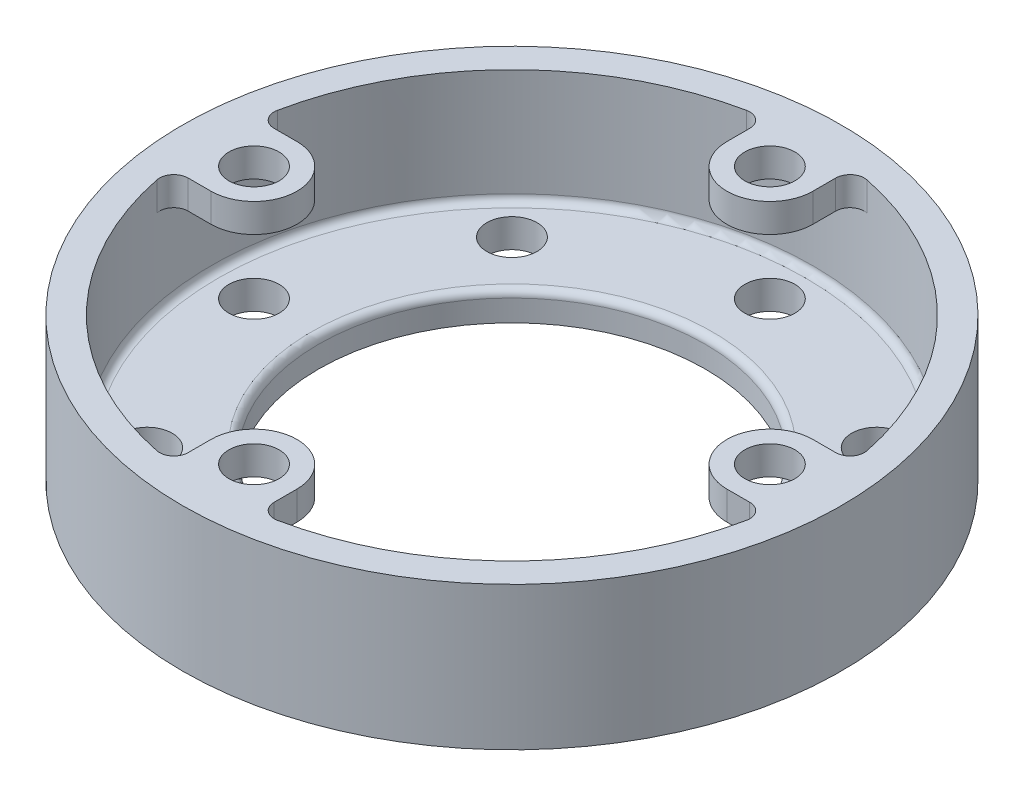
from build123d import *

# Parameters (mm, degrees)
SKETCH1_R                = 73.025
BASE_EXTRUDE_DEPTH       = 31.75
SHELL1_T                 = -6.35
SKETCH4_R                = 42.8625
CUT_EXTRUDE2_DEPTH       = 107.350652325
BOSS_EXTRUDE1_START      = -6.35
BOSS_EXTRUDE1_DEPTH      = 6.35
CUT_EXTRUDE1_REACH       = 110.043
SKETCH3_R                = 5.55625
FILLET1_R                = 3.175
CIRPATTERN1_COUNT        = 4
FILLET1_OF_CIRPATTERN1_R = 3.175
SKETCH5_R                = 5.55625
CUT_EXTRUDE3_DEPTH       = 107.350652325
CIRPATTERN2_COUNT        = 8
FILLET2_R                = 1.5875


with BuildPart() as part:
    # Sketch1 → Base-Extrude (new body)
    with BuildSketch(Plane(origin=(0, 0, 0), x_dir=(1, 0, 0), z_dir=(0, 1, 0))):
        with Locations(Location((0, 0, 0), (0, 0, 270))):
            Circle(SKETCH1_R)
    extrude(amount=BASE_EXTRUDE_DEPTH)

    # Shell1
    shell1_openings = [part.faces().sort_by_distance(p)[0] for p in [
        (0, 31.75, 0),
    ]]
    offset(amount=SHELL1_T, openings=shell1_openings, kind=Kind.INTERSECTION)

    # Sketch4 → Cut-Extrude2 (cut, through all)
    with BuildSketch(Plane(origin=(0, 6.35, 0), x_dir=(-1, 0, 0), z_dir=(0, 1, 0))):
        with Locations(Location((0, 0, 0), (0, 0, 90))):
            Circle(SKETCH4_R)
    extrude(amount=-CUT_EXTRUDE2_DEPTH, mode=Mode.SUBTRACT)

    # Sketch2 → Boss-Extrude1 (add)
    with BuildSketch(Plane(origin=(0, 31.75, 0), x_dir=(-1, 0, 0), z_dir=(0, 1, 0)).offset(BOSS_EXTRUDE1_START)):
        with BuildLine():
            Line((-9.525, -65.991135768), (-9.525, -57.15))
            ThreePointArc((-9.525, -57.15), (0, -47.625), (9.525, -57.15))
            Line((9.525, -57.15), (9.525, -65.991135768))
            ThreePointArc((9.525, -65.991135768), (0, -66.675), (-9.525, -65.991135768))
        make_face()
    boss_extrude1 = extrude(amount=BOSS_EXTRUDE1_DEPTH)

    # Sketch3 → Cut-Extrude1 (cut, up to next)
    with BuildSketch(Plane(origin=(0, 31.75, 0), x_dir=(-1, 0, 0), z_dir=(0, 1, 0)), mode=Mode.PRIVATE) as cut_extrude1_sk1:
        with Locations(Location((0, -57.15, 0), (0, 0, 90))):
            Circle(SKETCH3_R)
    cut_extrude1_tool1 = extrude(cut_extrude1_sk1.sketch, amount=-CUT_EXTRUDE1_REACH, mode=Mode.PRIVATE) & part.part
    cut_extrude1 = cut_extrude1_tool1.solids().sort_by_distance((0, 31.75, -57.15))[0]
    add(cut_extrude1, mode=Mode.SUBTRACT)

    # Fillet1
    fillet1_edges = [part.edges().sort_by_distance(p)[0] for p in [
        (-9.525, 28.575, -65.991135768),
        (9.525, 28.575, -65.991135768),
    ]]
    fillet(fillet1_edges, radius=FILLET1_R)

    # CirPattern1: Boss-Extrude1, Cut-Extrude1 ×4 about axis
    cirpattern1_axis = Axis((0, 0, 0), (0, 1, 0))
    add([boss_extrude1.rotate(cirpattern1_axis, i * 360 / CIRPATTERN1_COUNT) for i in range(1, CIRPATTERN1_COUNT)])
    add([cut_extrude1.rotate(cirpattern1_axis, i * 360 / CIRPATTERN1_COUNT) for i in range(1, CIRPATTERN1_COUNT)], mode=Mode.SUBTRACT)

    # Fillet1 of CirPattern1
    fillet1_of_cirpattern1_edges = [part.edges().sort_by_distance(p)[0] for p in [
        (-65.991135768, 28.575, 9.525),
        (-65.991135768, 28.575, -9.525),
        (9.525, 28.575, 65.991135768),
        (-9.525, 28.575, 65.991135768),
        (65.991135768, 28.575, -9.525),
        (65.991135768, 28.575, 9.525),
    ]]
    fillet(fillet1_of_cirpattern1_edges, radius=FILLET1_OF_CIRPATTERN1_R)

    # Sketch5 → Cut-Extrude3 (cut, through all)
    with BuildSketch(Plane(origin=(0, 6.35, 0), x_dir=(-1, 0, 0), z_dir=(0, 1, 0))):
        with Locations(Location((0, -57.15, 0), (0, 0, 90))):
            Circle(SKETCH5_R)
    cut_extrude3 = extrude(amount=-CUT_EXTRUDE3_DEPTH, mode=Mode.SUBTRACT)

    # CirPattern2: Cut-Extrude3 ×8 about axis
    cirpattern2_axis = Axis((0, 0, 0), (0, 1, 0))
    for i in range(1, CIRPATTERN2_COUNT):
        add(cut_extrude3.rotate(cirpattern2_axis, i * 360 / CIRPATTERN2_COUNT), mode=Mode.SUBTRACT)

    # Fillet2
    fillet2_edges = [part.edges().sort_by_distance(p)[0] for p in [
        (0, 6.35, -66.675),
        (0, 6.35, -42.8625),
    ]]
    fillet(fillet2_edges, radius=FILLET2_R)


solid = part.part
